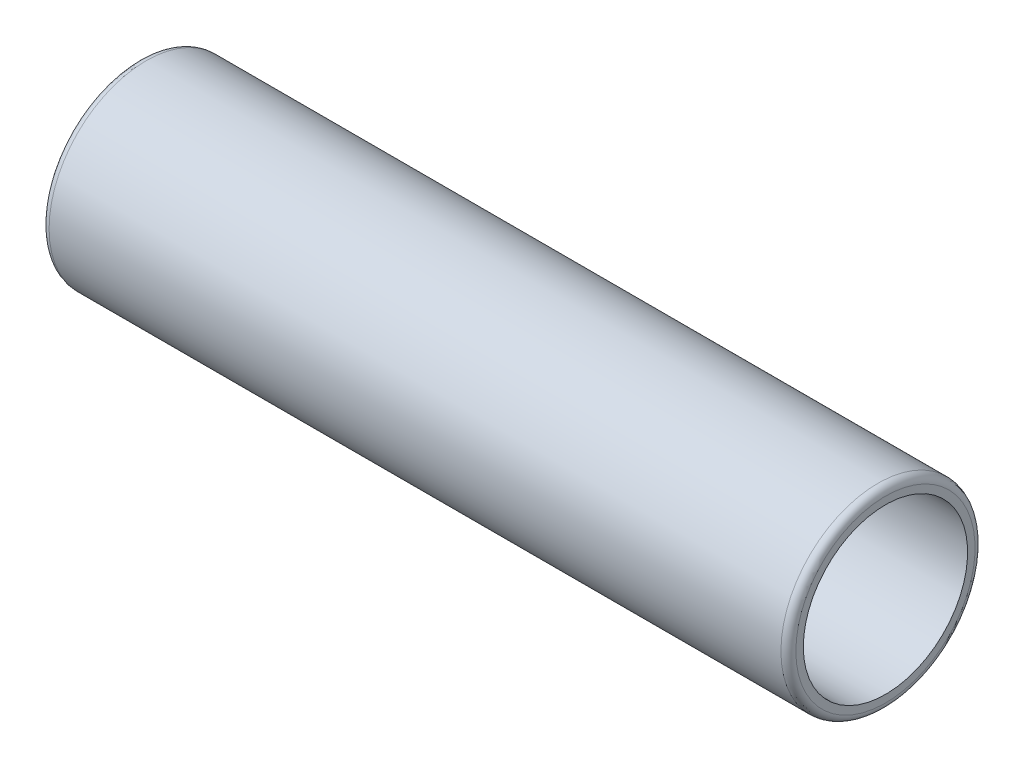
ISO-10303-21;
HEADER;
FILE_DESCRIPTION(('STEP AP214'),'2;1');
FILE_NAME('part.step','',(''),(''),'','','');
FILE_SCHEMA(('AUTOMOTIVE_DESIGN { 1 0 10303 214 1 1 1 1 }'));
ENDSEC;
DATA;
#1=APPLICATION_CONTEXT('core data for automotive mechanical design processes');
#2=APPLICATION_PROTOCOL_DEFINITION('international standard','automotive_design',2000,#1);
#3=PRODUCT_CONTEXT('',#1,'mechanical');
#4=PRODUCT('Part','Part','',(#3));
#5=PRODUCT_RELATED_PRODUCT_CATEGORY('part','',(#4));
#6=PRODUCT_DEFINITION_FORMATION('','',#4);
#7=PRODUCT_DEFINITION_CONTEXT('part definition',#1,'design');
#8=PRODUCT_DEFINITION('design','',#6,#7);
#9=PRODUCT_DEFINITION_SHAPE('','',#8);
#10=(LENGTH_UNIT() NAMED_UNIT(*) SI_UNIT(.MILLI.,.METRE.));
#11=(NAMED_UNIT(*) PLANE_ANGLE_UNIT() SI_UNIT($,.RADIAN.));
#12=(NAMED_UNIT(*) SI_UNIT($,.STERADIAN.) SOLID_ANGLE_UNIT());
#13=UNCERTAINTY_MEASURE_WITH_UNIT(LENGTH_MEASURE(1.E-05),#10,'distance_accuracy_value','');
#14=(GEOMETRIC_REPRESENTATION_CONTEXT(3) GLOBAL_UNCERTAINTY_ASSIGNED_CONTEXT((#13)) GLOBAL_UNIT_ASSIGNED_CONTEXT((#10,
#11,#12)) REPRESENTATION_CONTEXT('',''));
#15=CARTESIAN_POINT('',(0.,0.,0.));
#16=DIRECTION('',(0.,0.,1.));
#17=DIRECTION('',(1.,0.,0.));
#18=AXIS2_PLACEMENT_3D('',#15,#16,#17);
#19=CARTESIAN_POINT('',(0.,0.,0.));
#20=DIRECTION('',(-1.,0.,0.));
#21=DIRECTION('',(0.,0.,1.));
#22=AXIS2_PLACEMENT_3D('',#19,#20,#21);
#23=CYLINDRICAL_SURFACE('',#22,6.);
#24=CARTESIAN_POINT('',(8.,0.,0.));
#25=DIRECTION('',(-1.,0.,0.));
#26=DIRECTION('',(0.,0.,1.));
#27=AXIS2_PLACEMENT_3D('',#24,#25,#26);
#28=CIRCLE('',#27,6.);
#29=CARTESIAN_POINT('',(8.,0.,6.));
#30=VERTEX_POINT('',#29);
#31=EDGE_CURVE('E43',#30,#30,#28,.T.);
#32=ORIENTED_EDGE('',*,*,#31,.F.);
#33=EDGE_LOOP('',(#32));
#34=FACE_BOUND('',#33,.T.);
#35=CARTESIAN_POINT('',(0.,0.,0.));
#36=DIRECTION('',(-1.,0.,0.));
#37=DIRECTION('',(0.,0.,1.));
#38=AXIS2_PLACEMENT_3D('',#35,#36,#37);
#39=CIRCLE('',#38,6.);
#40=CARTESIAN_POINT('',(0.,0.,6.));
#41=VERTEX_POINT('',#40);
#42=EDGE_CURVE('E34',#41,#41,#39,.T.);
#43=ORIENTED_EDGE('',*,*,#42,.T.);
#44=EDGE_LOOP('',(#43));
#45=FACE_BOUND('',#44,.T.);
#46=ADVANCED_FACE('F14',(#34,#45),#23,.F.);
#47=CARTESIAN_POINT('',(0.,6.,0.));
#48=DIRECTION('',(1.,0.,0.));
#49=DIRECTION('',(0.,0.,-1.));
#50=AXIS2_PLACEMENT_3D('',#47,#48,#49);
#51=PLANE('',#50);
#52=CARTESIAN_POINT('',(0.,0.,0.));
#53=DIRECTION('',(1.,0.,0.));
#54=DIRECTION('',(0.,0.,-1.));
#55=AXIS2_PLACEMENT_3D('',#52,#53,#54);
#56=CIRCLE('',#55,12.);
#57=CARTESIAN_POINT('',(0.,0.,-12.));
#58=VERTEX_POINT('',#57);
#59=EDGE_CURVE('E21',#58,#58,#56,.F.);
#60=ORIENTED_EDGE('',*,*,#59,.T.);
#61=EDGE_LOOP('',(#60));
#62=FACE_BOUND('',#61,.T.);
#63=ORIENTED_EDGE('',*,*,#42,.F.);
#64=EDGE_LOOP('',(#63));
#65=FACE_BOUND('',#64,.T.);
#66=ADVANCED_FACE('F51',(#62,#65),#51,.F.);
#67=CARTESIAN_POINT('',(0.,0.,0.));
#68=DIRECTION('',(-1.,0.,0.));
#69=DIRECTION('',(0.,0.,1.));
#70=AXIS2_PLACEMENT_3D('',#67,#68,#69);
#71=CYLINDRICAL_SURFACE('',#70,13.);
#72=CARTESIAN_POINT('',(1.,0.,0.));
#73=DIRECTION('',(1.,0.,0.));
#74=DIRECTION('',(0.,0.,-1.));
#75=AXIS2_PLACEMENT_3D('',#72,#73,#74);
#76=CIRCLE('',#75,13.);
#77=CARTESIAN_POINT('',(1.,0.,-13.));
#78=VERTEX_POINT('',#77);
#79=EDGE_CURVE('E9',#78,#78,#76,.T.);
#80=ORIENTED_EDGE('',*,*,#79,.T.);
#81=EDGE_LOOP('',(#80));
#82=FACE_BOUND('',#81,.T.);
#83=CARTESIAN_POINT('',(99.,0.,0.));
#84=DIRECTION('',(-1.,0.,0.));
#85=DIRECTION('',(0.,0.,1.));
#86=AXIS2_PLACEMENT_3D('',#83,#84,#85);
#87=CIRCLE('',#86,13.);
#88=CARTESIAN_POINT('',(99.,0.,13.));
#89=VERTEX_POINT('',#88);
#90=EDGE_CURVE('E29',#89,#89,#87,.T.);
#91=ORIENTED_EDGE('',*,*,#90,.T.);
#92=EDGE_LOOP('',(#91));
#93=FACE_BOUND('',#92,.T.);
#94=ADVANCED_FACE('F56',(#82,#93),#71,.T.);
#95=CARTESIAN_POINT('',(100.,13.,0.));
#96=DIRECTION('',(-1.,0.,0.));
#97=DIRECTION('',(0.,0.,1.));
#98=AXIS2_PLACEMENT_3D('',#95,#96,#97);
#99=PLANE('',#98);
#100=CARTESIAN_POINT('',(100.,0.,0.));
#101=DIRECTION('',(-1.,0.,0.));
#102=DIRECTION('',(0.,0.,1.));
#103=AXIS2_PLACEMENT_3D('',#100,#101,#102);
#104=CIRCLE('',#103,12.);
#105=CARTESIAN_POINT('',(100.,0.,12.));
#106=VERTEX_POINT('',#105);
#107=EDGE_CURVE('E25',#106,#106,#104,.F.);
#108=ORIENTED_EDGE('',*,*,#107,.T.);
#109=EDGE_LOOP('',(#108));
#110=FACE_BOUND('',#109,.T.);
#111=CARTESIAN_POINT('',(100.,0.,0.));
#112=DIRECTION('',(-1.,0.,0.));
#113=DIRECTION('',(0.,0.,1.));
#114=AXIS2_PLACEMENT_3D('',#111,#112,#113);
#115=CIRCLE('',#114,11.);
#116=CARTESIAN_POINT('',(100.,0.,11.));
#117=VERTEX_POINT('',#116);
#118=EDGE_CURVE('E37',#117,#117,#115,.T.);
#119=ORIENTED_EDGE('',*,*,#118,.T.);
#120=EDGE_LOOP('',(#119));
#121=FACE_BOUND('',#120,.T.);
#122=ADVANCED_FACE('F63',(#110,#121),#99,.F.);
#123=CARTESIAN_POINT('',(0.,0.,0.));
#124=DIRECTION('',(-1.,0.,0.));
#125=DIRECTION('',(0.,0.,1.));
#126=AXIS2_PLACEMENT_3D('',#123,#124,#125);
#127=CYLINDRICAL_SURFACE('',#126,11.);
#128=ORIENTED_EDGE('',*,*,#118,.F.);
#129=EDGE_LOOP('',(#128));
#130=FACE_BOUND('',#129,.T.);
#131=CARTESIAN_POINT('',(13.,0.,0.));
#132=DIRECTION('',(-1.,0.,0.));
#133=DIRECTION('',(0.,0.,1.));
#134=AXIS2_PLACEMENT_3D('',#131,#132,#133);
#135=CIRCLE('',#134,11.);
#136=CARTESIAN_POINT('',(13.,0.,11.));
#137=VERTEX_POINT('',#136);
#138=EDGE_CURVE('E40',#137,#137,#135,.T.);
#139=ORIENTED_EDGE('',*,*,#138,.T.);
#140=EDGE_LOOP('',(#139));
#141=FACE_BOUND('',#140,.T.);
#142=ADVANCED_FACE('F75',(#130,#141),#127,.F.);
#143=CARTESIAN_POINT('',(8.,0.,0.));
#144=DIRECTION('',(1.,0.,0.));
#145=DIRECTION('',(0.,0.,-1.));
#146=AXIS2_PLACEMENT_3D('',#143,#144,#145);
#147=CONICAL_SURFACE('',#146,6.,0.785398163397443);
#148=ORIENTED_EDGE('',*,*,#138,.F.);
#149=EDGE_LOOP('',(#148));
#150=FACE_BOUND('',#149,.T.);
#151=ORIENTED_EDGE('',*,*,#31,.T.);
#152=EDGE_LOOP('',(#151));
#153=FACE_BOUND('',#152,.T.);
#154=ADVANCED_FACE('F47',(#150,#153),#147,.F.);
#155=CARTESIAN_POINT('',(99.,0.,0.));
#156=DIRECTION('',(-1.,0.,0.));
#157=DIRECTION('',(0.,0.,1.));
#158=AXIS2_PLACEMENT_3D('',#155,#156,#157);
#159=TOROIDAL_SURFACE('',#158,12.,1.);
#160=ORIENTED_EDGE('',*,*,#107,.F.);
#161=EDGE_LOOP('',(#160));
#162=FACE_BOUND('',#161,.T.);
#163=ORIENTED_EDGE('',*,*,#90,.F.);
#164=EDGE_LOOP('',(#163));
#165=FACE_BOUND('',#164,.T.);
#166=ADVANCED_FACE('F66',(#162,#165),#159,.T.);
#167=CARTESIAN_POINT('',(1.,0.,0.));
#168=DIRECTION('',(1.,0.,0.));
#169=DIRECTION('',(0.,0.,-1.));
#170=AXIS2_PLACEMENT_3D('',#167,#168,#169);
#171=TOROIDAL_SURFACE('',#170,12.,1.);
#172=ORIENTED_EDGE('',*,*,#79,.F.);
#173=EDGE_LOOP('',(#172));
#174=FACE_BOUND('',#173,.T.);
#175=ORIENTED_EDGE('',*,*,#59,.F.);
#176=EDGE_LOOP('',(#175));
#177=FACE_BOUND('',#176,.T.);
#178=ADVANCED_FACE('F16',(#174,#177),#171,.T.);
#179=CLOSED_SHELL('',(#46,#66,#94,#122,#142,#154,#166,#178));
#180=MANIFOLD_SOLID_BREP('B1',#179);
#181=ADVANCED_BREP_SHAPE_REPRESENTATION('',(#18,#180),#14);
#182=SHAPE_DEFINITION_REPRESENTATION(#9,#181);
ENDSEC;
END-ISO-10303-21;
